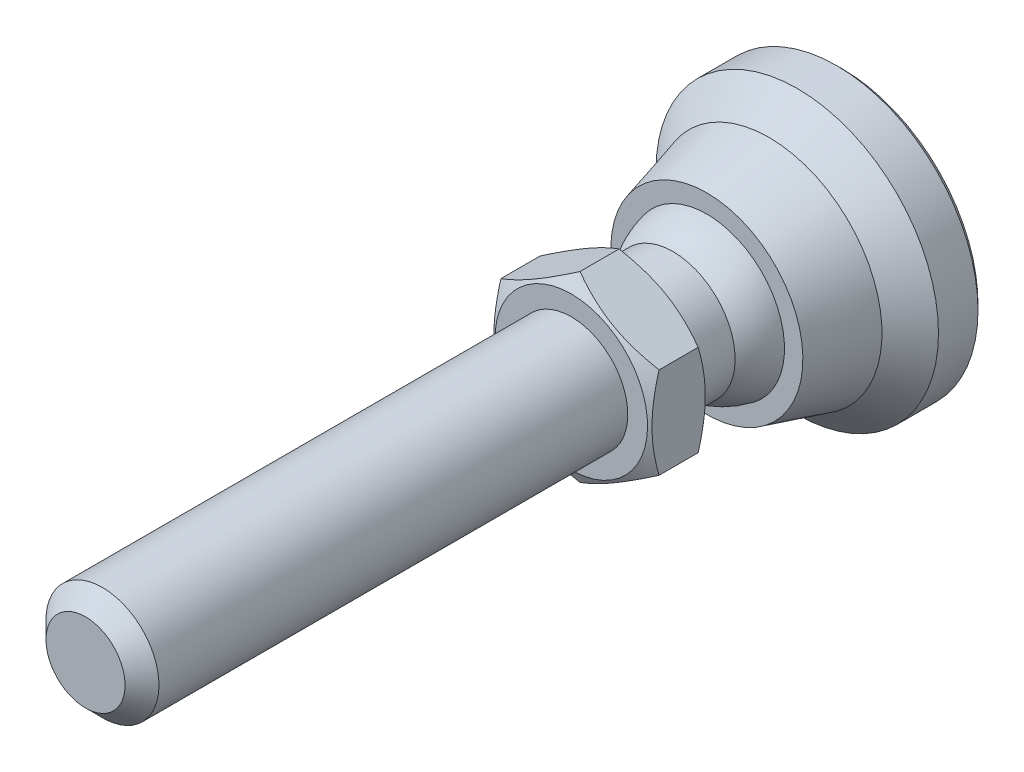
ISO-10303-21;
HEADER;
FILE_DESCRIPTION(('STEP AP214'),'2;1');
FILE_NAME('part.step','',(''),(''),'','','');
FILE_SCHEMA(('AUTOMOTIVE_DESIGN { 1 0 10303 214 1 1 1 1 }'));
ENDSEC;
DATA;
#1=APPLICATION_CONTEXT('core data for automotive mechanical design processes');
#2=APPLICATION_PROTOCOL_DEFINITION('international standard','automotive_design',2000,#1);
#3=PRODUCT_CONTEXT('',#1,'mechanical');
#4=PRODUCT('Part','Part','',(#3));
#5=PRODUCT_RELATED_PRODUCT_CATEGORY('part','',(#4));
#6=PRODUCT_DEFINITION_FORMATION('','',#4);
#7=PRODUCT_DEFINITION_CONTEXT('part definition',#1,'design');
#8=PRODUCT_DEFINITION('design','',#6,#7);
#9=PRODUCT_DEFINITION_SHAPE('','',#8);
#10=(LENGTH_UNIT() NAMED_UNIT(*) SI_UNIT(.MILLI.,.METRE.));
#11=(NAMED_UNIT(*) PLANE_ANGLE_UNIT() SI_UNIT($,.RADIAN.));
#12=(NAMED_UNIT(*) SI_UNIT($,.STERADIAN.) SOLID_ANGLE_UNIT());
#13=UNCERTAINTY_MEASURE_WITH_UNIT(LENGTH_MEASURE(1.E-05),#10,'distance_accuracy_value','');
#14=(GEOMETRIC_REPRESENTATION_CONTEXT(3) GLOBAL_UNCERTAINTY_ASSIGNED_CONTEXT((#13)) GLOBAL_UNIT_ASSIGNED_CONTEXT((#10,
#11,#12)) REPRESENTATION_CONTEXT('',''));
#15=CARTESIAN_POINT('',(0.,0.,0.));
#16=DIRECTION('',(0.,0.,1.));
#17=DIRECTION('',(1.,0.,0.));
#18=AXIS2_PLACEMENT_3D('',#15,#16,#17);
#19=CARTESIAN_POINT('',(-5.49999999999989,0.,19.));
#20=DIRECTION('',(0.,0.,1.));
#21=DIRECTION('',(0.,-1.,0.));
#22=AXIS2_PLACEMENT_3D('',#19,#20,#21);
#23=PLANE('',#22);
#24=CARTESIAN_POINT('',(0.,0.,19.));
#25=DIRECTION('',(0.,0.,-1.));
#26=DIRECTION('',(0.,1.,0.));
#27=AXIS2_PLACEMENT_3D('',#24,#25,#26);
#28=CIRCLE('',#27,5.49999999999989);
#29=CARTESIAN_POINT('',(0.,5.49999999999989,19.));
#30=VERTEX_POINT('',#29);
#31=EDGE_CURVE('E115',#30,#30,#28,.T.);
#32=ORIENTED_EDGE('',*,*,#31,.F.);
#33=EDGE_LOOP('',(#32));
#34=FACE_BOUND('',#33,.T.);
#35=CARTESIAN_POINT('',(0.,0.,18.9999999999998));
#36=DIRECTION('',(0.,0.,-1.));
#37=DIRECTION('',(0.,1.,0.));
#38=AXIS2_PLACEMENT_3D('',#35,#36,#37);
#39=CIRCLE('',#38,6.75);
#40=CARTESIAN_POINT('',(0.,6.75,18.9999999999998));
#41=VERTEX_POINT('',#40);
#42=EDGE_CURVE('E73',#41,#41,#39,.T.);
#43=ORIENTED_EDGE('',*,*,#42,.T.);
#44=EDGE_LOOP('',(#43));
#45=FACE_BOUND('',#44,.T.);
#46=ADVANCED_FACE('F14',(#34,#45),#23,.F.);
#47=CARTESIAN_POINT('',(0.,0.,0.));
#48=DIRECTION('',(0.,0.,-1.));
#49=DIRECTION('',(0.,1.,0.));
#50=AXIS2_PLACEMENT_3D('',#47,#48,#49);
#51=CYLINDRICAL_SURFACE('',#50,5.49999999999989);
#52=CARTESIAN_POINT('',(0.,0.,15.));
#53=DIRECTION('',(0.,0.,-1.));
#54=DIRECTION('',(0.,1.,0.));
#55=AXIS2_PLACEMENT_3D('',#52,#53,#54);
#56=CIRCLE('',#55,5.49999999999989);
#57=CARTESIAN_POINT('',(-5.49999999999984,0.,15.));
#58=VERTEX_POINT('',#57);
#59=EDGE_CURVE('E112',#58,#58,#56,.T.);
#60=ORIENTED_EDGE('',*,*,#59,.F.);
#61=EDGE_LOOP('',(#60));
#62=FACE_BOUND('',#61,.T.);
#63=ORIENTED_EDGE('',*,*,#31,.T.);
#64=EDGE_LOOP('',(#63));
#65=FACE_BOUND('',#64,.T.);
#66=ADVANCED_FACE('F139',(#62,#65),#51,.T.);
#67=CARTESIAN_POINT('',(1.11022302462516E-13,0.,10.6698729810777));
#68=DIRECTION('',(0.,0.,-1.));
#69=DIRECTION('',(-1.,0.,0.));
#70=AXIS2_PLACEMENT_3D('',#67,#68,#69);
#71=SPHERICAL_SURFACE('',#70,7.);
#72=CARTESIAN_POINT('',(0.,0.,12.));
#73=DIRECTION('',(0.,0.,-1.));
#74=DIRECTION('',(0.,1.,0.));
#75=AXIS2_PLACEMENT_3D('',#72,#73,#74);
#76=CIRCLE('',#75,6.87246404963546);
#77=CARTESIAN_POINT('',(-6.87246404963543,0.,12.));
#78=VERTEX_POINT('',#77);
#79=EDGE_CURVE('E109',#78,#78,#76,.T.);
#80=CARTESIAN_POINT('',(-6.87246404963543,0.,12.));
#81=CARTESIAN_POINT('',(-6.86587210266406,0.,12.0340591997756));
#82=CARTESIAN_POINT('',(-6.85902692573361,0.,12.0680693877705));
#83=CARTESIAN_POINT('',(-6.84483171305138,0.,12.1359842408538));
#84=CARTESIAN_POINT('',(-6.8374816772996,0.,12.1698889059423));
#85=CARTESIAN_POINT('',(-6.82227834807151,0.,12.2375852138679));
#86=CARTESIAN_POINT('',(-6.8144250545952,0.,12.2713768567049));
#87=CARTESIAN_POINT('',(-6.79821695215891,0.,12.3388396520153));
#88=CARTESIAN_POINT('',(-6.78986214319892,0.,12.3725108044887));
#89=CARTESIAN_POINT('',(-6.77265285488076,0.,12.4397251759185));
#90=CARTESIAN_POINT('',(-6.76379837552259,0.,12.473268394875));
#91=CARTESIAN_POINT('',(-6.74559170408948,0.,12.5402194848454));
#92=CARTESIAN_POINT('',(-6.73623951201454,0.,12.5736273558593));
#93=CARTESIAN_POINT('',(-6.71703948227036,0.,12.6403003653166));
#94=CARTESIAN_POINT('',(-6.70719164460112,0.,12.67356550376));
#95=CARTESIAN_POINT('',(-6.68700250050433,0.,12.7399456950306));
#96=CARTESIAN_POINT('',(-6.67666119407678,0.,12.7730607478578));
#97=CARTESIAN_POINT('',(-6.65548739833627,0.,12.8391334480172));
#98=CARTESIAN_POINT('',(-6.6446549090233,0.,12.8720910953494));
#99=CARTESIAN_POINT('',(-6.62250114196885,0.,12.9378416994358));
#100=CARTESIAN_POINT('',(-6.61117986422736,0.,12.9706346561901));
#101=CARTESIAN_POINT('',(-6.58805102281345,0.,13.0360486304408));
#102=CARTESIAN_POINT('',(-6.57624345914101,0.,13.0686696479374));
#103=CARTESIAN_POINT('',(-6.55214465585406,0.,13.1337325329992));
#104=CARTESIAN_POINT('',(-6.53985341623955,0.,13.1661744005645));
#105=CARTESIAN_POINT('',(-6.51478997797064,0.,13.2308718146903));
#106=CARTESIAN_POINT('',(-6.50201777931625,0.,13.2631273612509));
#107=CARTESIAN_POINT('',(-6.47599524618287,0.,13.3274450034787));
#108=CARTESIAN_POINT('',(-6.46274491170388,0.,13.3595070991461));
#109=CARTESIAN_POINT('',(-6.43576903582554,0.,13.4234307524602));
#110=CARTESIAN_POINT('',(-6.42204349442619,0.,13.455292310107));
#111=CARTESIAN_POINT('',(-6.39412023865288,0.,13.5188078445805));
#112=CARTESIAN_POINT('',(-6.37992252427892,0.,13.5504618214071));
#113=CARTESIAN_POINT('',(-6.35105806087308,0.,13.6135551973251));
#114=CARTESIAN_POINT('',(-6.33639131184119,0.,13.6449945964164));
#115=CARTESIAN_POINT('',(-6.30659202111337,0.,13.7076518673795));
#116=CARTESIAN_POINT('',(-6.29145947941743,0.,13.7388697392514));
#117=CARTESIAN_POINT('',(-6.26073194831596,0.,13.8010770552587));
#118=CARTESIAN_POINT('',(-6.24513695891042,0.,13.8320664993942));
#119=CARTESIAN_POINT('',(-6.2134879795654,0.,13.8938101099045));
#120=CARTESIAN_POINT('',(-6.19743398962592,0.,13.9245642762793));
#121=CARTESIAN_POINT('',(-6.16487055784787,0.,13.9858305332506));
#122=CARTESIAN_POINT('',(-6.1483611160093,0.,14.016342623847));
#123=CARTESIAN_POINT('',(-6.11489042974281,0.,14.0771179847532));
#124=CARTESIAN_POINT('',(-6.09792918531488,0.,14.107381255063));
#125=CARTESIAN_POINT('',(-6.06355864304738,0.,14.1676522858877));
#126=CARTESIAN_POINT('',(-6.0461493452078,0.,14.1976600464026));
#127=CARTESIAN_POINT('',(-6.01088654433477,0.,14.2574134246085));
#128=CARTESIAN_POINT('',(-5.99303304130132,0.,14.2871590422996));
#129=CARTESIAN_POINT('',(-5.95688577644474,0.,14.3463815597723));
#130=CARTESIAN_POINT('',(-5.9385920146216,0.,14.3758584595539));
#131=CARTESIAN_POINT('',(-5.90156827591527,0.,14.4345370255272));
#132=CARTESIAN_POINT('',(-5.88283829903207,0.,14.4637386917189));
#133=CARTESIAN_POINT('',(-5.84494627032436,0.,14.5218603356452));
#134=CARTESIAN_POINT('',(-5.82578421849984,0.,14.5507803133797));
#135=CARTESIAN_POINT('',(-5.78703227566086,0.,14.6083321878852));
#136=CARTESIAN_POINT('',(-5.76744238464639,0.,14.6369640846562));
#137=CARTESIAN_POINT('',(-5.72783909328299,0.,14.6939334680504));
#138=CARTESIAN_POINT('',(-5.70782569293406,0.,14.7222709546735));
#139=CARTESIAN_POINT('',(-5.66737980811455,0.,14.778645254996));
#140=CARTESIAN_POINT('',(-5.64694732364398,0.,14.8066820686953));
#141=CARTESIAN_POINT('',(-5.60566778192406,0.,14.862448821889));
#142=CARTESIAN_POINT('',(-5.58482072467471,0.,14.8901787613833));
#143=CARTESIAN_POINT('',(-5.5427166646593,0.,14.9453256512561));
#144=CARTESIAN_POINT('',(-5.52145966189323,0.,14.9727426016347));
#145=CARTESIAN_POINT('',(-5.49999999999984,0.,15.));
#146=B_SPLINE_CURVE_WITH_KNOTS('',3,(#80,#81,#82,#83,#84,#85,#86,#87,#88,#89,#90,#91,#92,#93,
#94,#95,#96,#97,#98,#99,#100,#101,#102,#103,#104,#105,#106,#107,#108,#109,#110,#111,#112,#113,
#114,#115,#116,#117,#118,#119,#120,#121,#122,#123,#124,#125,#126,#127,#128,#129,#130,#131,#132,
#133,#134,#135,#136,#137,#138,#139,#140,#141,#142,#143,#144,#145),.UNSPECIFIED.,.F.,.F.,(4,2,2,
2,2,2,2,2,2,2,2,2,2,2,2,2,2,2,2,2,2,2,2,2,2,2,2,2,2,2,2,2,4),(0.,0.104072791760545,
0.208145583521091,0.312218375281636,0.416291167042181,0.520363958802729,0.624436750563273,
0.72850954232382,0.832582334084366,0.936655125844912,1.04072791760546,1.144800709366,
1.24887350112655,1.35294629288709,1.45701908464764,1.56109187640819,1.66516466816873,
1.76923745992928,1.87331025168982,1.97738304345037,2.08145583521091,2.18552862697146,
2.28960141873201,2.39367421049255,2.4977470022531,2.60181979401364,2.70589258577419,
2.80996537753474,2.91403816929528,3.01811096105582,3.12218375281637,3.22625654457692,
3.33032933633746),.UNSPECIFIED.);
#147=EDGE_CURVE('BSEAM146',#78,#58,#146,.T.);
#148=ORIENTED_EDGE('',*,*,#79,.F.);
#149=ORIENTED_EDGE('',*,*,#59,.T.);
#150=ORIENTED_EDGE('',*,*,#147,.T.);
#151=ORIENTED_EDGE('',*,*,#147,.F.);
#152=EDGE_LOOP('',(#148,#150,#149,#151));
#153=FACE_BOUND('',#152,.T.);
#154=ADVANCED_FACE('F146',(#153),#71,.T.);
#155=CARTESIAN_POINT('',(-8.5,0.,12.));
#156=DIRECTION('',(0.,0.,-1.));
#157=DIRECTION('',(0.,1.,0.));
#158=AXIS2_PLACEMENT_3D('',#155,#156,#157);
#159=PLANE('',#158);
#160=CARTESIAN_POINT('',(0.,0.,12.));
#161=DIRECTION('',(0.,0.,-1.));
#162=DIRECTION('',(0.,1.,0.));
#163=AXIS2_PLACEMENT_3D('',#160,#161,#162);
#164=CIRCLE('',#163,8.5);
#165=CARTESIAN_POINT('',(0.,8.5,12.));
#166=VERTEX_POINT('',#165);
#167=EDGE_CURVE('E106',#166,#166,#164,.T.);
#168=ORIENTED_EDGE('',*,*,#167,.F.);
#169=EDGE_LOOP('',(#168));
#170=FACE_BOUND('',#169,.T.);
#171=ORIENTED_EDGE('',*,*,#79,.T.);
#172=EDGE_LOOP('',(#171));
#173=FACE_BOUND('',#172,.T.);
#174=ADVANCED_FACE('F250',(#170,#173),#159,.F.);
#175=CARTESIAN_POINT('',(0.,0.,12.));
#176=DIRECTION('',(0.,0.,-1.));
#177=DIRECTION('',(0.,1.,0.));
#178=AXIS2_PLACEMENT_3D('',#175,#176,#177);
#179=CONICAL_SURFACE('',#178,8.5,0.266252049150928);
#180=CARTESIAN_POINT('',(0.,0.,6.5));
#181=DIRECTION('',(0.,0.,-1.));
#182=DIRECTION('',(0.,1.,0.));
#183=AXIS2_PLACEMENT_3D('',#180,#181,#182);
#184=CIRCLE('',#183,10.);
#185=CARTESIAN_POINT('',(0.,10.,6.5));
#186=VERTEX_POINT('',#185);
#187=EDGE_CURVE('E103',#186,#186,#184,.T.);
#188=ORIENTED_EDGE('',*,*,#187,.F.);
#189=EDGE_LOOP('',(#188));
#190=FACE_BOUND('',#189,.T.);
#191=ORIENTED_EDGE('',*,*,#167,.T.);
#192=EDGE_LOOP('',(#191));
#193=FACE_BOUND('',#192,.T.);
#194=ADVANCED_FACE('F246',(#190,#193),#179,.T.);
#195=CARTESIAN_POINT('',(0.,0.,6.5));
#196=DIRECTION('',(0.,0.,-1.));
#197=DIRECTION('',(0.,1.,0.));
#198=AXIS2_PLACEMENT_3D('',#195,#196,#197);
#199=CONICAL_SURFACE('',#198,10.,0.785398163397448);
#200=CARTESIAN_POINT('',(0.,0.,4.));
#201=DIRECTION('',(0.,0.,-1.));
#202=DIRECTION('',(0.,1.,0.));
#203=AXIS2_PLACEMENT_3D('',#200,#201,#202);
#204=CIRCLE('',#203,12.5);
#205=CARTESIAN_POINT('',(0.,12.5,4.));
#206=VERTEX_POINT('',#205);
#207=EDGE_CURVE('E100',#206,#206,#204,.T.);
#208=ORIENTED_EDGE('',*,*,#207,.F.);
#209=EDGE_LOOP('',(#208));
#210=FACE_BOUND('',#209,.T.);
#211=ORIENTED_EDGE('',*,*,#187,.T.);
#212=EDGE_LOOP('',(#211));
#213=FACE_BOUND('',#212,.T.);
#214=ADVANCED_FACE('F242',(#210,#213),#199,.T.);
#215=CARTESIAN_POINT('',(0.,0.,0.));
#216=DIRECTION('',(0.,0.,-1.));
#217=DIRECTION('',(0.,1.,0.));
#218=AXIS2_PLACEMENT_3D('',#215,#216,#217);
#219=CYLINDRICAL_SURFACE('',#218,12.5);
#220=CARTESIAN_POINT('',(0.,0.,0.5));
#221=DIRECTION('',(0.,0.,-1.));
#222=DIRECTION('',(0.,1.,0.));
#223=AXIS2_PLACEMENT_3D('',#220,#221,#222);
#224=CIRCLE('',#223,12.5);
#225=CARTESIAN_POINT('',(0.,12.5,0.5));
#226=VERTEX_POINT('',#225);
#227=EDGE_CURVE('E97',#226,#226,#224,.T.);
#228=ORIENTED_EDGE('',*,*,#227,.F.);
#229=EDGE_LOOP('',(#228));
#230=FACE_BOUND('',#229,.T.);
#231=ORIENTED_EDGE('',*,*,#207,.T.);
#232=EDGE_LOOP('',(#231));
#233=FACE_BOUND('',#232,.T.);
#234=ADVANCED_FACE('F238',(#230,#233),#219,.T.);
#235=CARTESIAN_POINT('',(0.,0.,0.5));
#236=DIRECTION('',(0.,0.,1.));
#237=DIRECTION('',(0.,-1.,0.));
#238=AXIS2_PLACEMENT_3D('',#235,#236,#237);
#239=CONICAL_SURFACE('',#238,12.5,0.785398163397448);
#240=CARTESIAN_POINT('',(0.,0.,0.));
#241=DIRECTION('',(0.,0.,-1.));
#242=DIRECTION('',(0.,1.,0.));
#243=AXIS2_PLACEMENT_3D('',#240,#241,#242);
#244=CIRCLE('',#243,12.);
#245=CARTESIAN_POINT('',(0.,12.,0.));
#246=VERTEX_POINT('',#245);
#247=EDGE_CURVE('E94',#246,#246,#244,.T.);
#248=ORIENTED_EDGE('',*,*,#247,.F.);
#249=EDGE_LOOP('',(#248));
#250=FACE_BOUND('',#249,.T.);
#251=ORIENTED_EDGE('',*,*,#227,.T.);
#252=EDGE_LOOP('',(#251));
#253=FACE_BOUND('',#252,.T.);
#254=ADVANCED_FACE('F234',(#250,#253),#239,.T.);
#255=CARTESIAN_POINT('',(-12.,0.,0.));
#256=DIRECTION('',(0.,0.,1.));
#257=DIRECTION('',(0.,-1.,0.));
#258=AXIS2_PLACEMENT_3D('',#255,#256,#257);
#259=PLANE('',#258);
#260=ORIENTED_EDGE('',*,*,#247,.T.);
#261=EDGE_LOOP('',(#260));
#262=FACE_BOUND('',#261,.T.);
#263=ADVANCED_FACE('F136',(#262),#259,.F.);
#264=CARTESIAN_POINT('',(0.,0.,18.9999999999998));
#265=DIRECTION('',(0.,0.,1.));
#266=DIRECTION('',(0.,-1.,0.));
#267=AXIS2_PLACEMENT_3D('',#264,#265,#266);
#268=CONICAL_SURFACE('',#267,6.75,1.0471975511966);
#269=CARTESIAN_POINT('',(-7.,10.8505398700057,22.5579558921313));
#270=CARTESIAN_POINT('',(-7.,10.5448474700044,22.4096889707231));
#271=CARTESIAN_POINT('',(-7.,10.2384527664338,22.2628452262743));
#272=CARTESIAN_POINT('',(-7.,9.62388523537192,21.9728046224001));
#273=CARTESIAN_POINT('',(-7.,9.31571213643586,21.8296083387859));
#274=CARTESIAN_POINT('',(-7.,8.69562398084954,21.5469416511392));
#275=CARTESIAN_POINT('',(-7.,8.38369768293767,21.4074958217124));
#276=CARTESIAN_POINT('',(-7.,7.75736232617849,21.1343178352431));
#277=CARTESIAN_POINT('',(-7.,7.442953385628,21.0005854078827));
#278=CARTESIAN_POINT('',(-7.,6.80102569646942,20.7361715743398));
#279=CARTESIAN_POINT('',(-7.,6.47340962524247,20.6057251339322));
#280=CARTESIAN_POINT('',(-7.,5.81434344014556,20.3547177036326));
#281=CARTESIAN_POINT('',(-7.,5.48289290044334,20.2341578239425));
#282=CARTESIAN_POINT('',(-7.,4.81624852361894,20.0060926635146));
#283=CARTESIAN_POINT('',(-7.,4.48106384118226,19.8985609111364));
#284=CARTESIAN_POINT('',(-7.,3.80589849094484,19.7000045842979));
#285=CARTESIAN_POINT('',(-7.,3.4659193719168,19.6089748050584));
#286=CARTESIAN_POINT('',(-7.,2.78280098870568,19.4482842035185));
#287=CARTESIAN_POINT('',(-7.,2.43968968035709,19.3785077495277));
#288=CARTESIAN_POINT('',(-7.,1.92190245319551,19.2928066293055));
#289=CARTESIAN_POINT('',(-7.,1.74877391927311,19.2673990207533));
#290=CARTESIAN_POINT('',(-7.,1.40165810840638,19.2234034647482));
#291=CARTESIAN_POINT('',(-7.,1.22767091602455,19.2048148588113));
#292=CARTESIAN_POINT('',(-7.,0.8813416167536,19.1750605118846));
#293=CARTESIAN_POINT('',(-7.,0.709007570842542,19.1638013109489));
#294=CARTESIAN_POINT('',(-7.,0.364017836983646,19.1485801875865));
#295=CARTESIAN_POINT('',(-7.,0.191362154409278,19.1446181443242));
#296=CARTESIAN_POINT('',(-7.,-0.153962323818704,19.144085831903));
#297=CARTESIAN_POINT('',(-7.,-0.326631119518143,19.1475155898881));
#298=CARTESIAN_POINT('',(-7.,-0.671670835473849,19.1616831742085));
#299=CARTESIAN_POINT('',(-7.,-0.844041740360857,19.1724213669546));
#300=CARTESIAN_POINT('',(-7.,-1.25845901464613,19.2067970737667));
#301=CARTESIAN_POINT('',(-7.,-1.50022308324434,19.233910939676));
#302=CARTESIAN_POINT('',(-7.,-1.98194203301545,19.3010355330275));
#303=CARTESIAN_POINT('',(-7.,-2.22189666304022,19.3410480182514));
#304=CARTESIAN_POINT('',(-7.,-2.93878025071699,19.4783104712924));
#305=CARTESIAN_POINT('',(-7.,-3.41245871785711,19.5927600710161));
#306=CARTESIAN_POINT('',(-7.,-4.1207304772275,19.7910439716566));
#307=CARTESIAN_POINT('',(-7.,-4.35900205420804,19.8624934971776));
#308=CARTESIAN_POINT('',(-7.,-4.83323061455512,20.0127684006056));
#309=CARTESIAN_POINT('',(-7.,-5.06918758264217,20.0915938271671));
#310=CARTESIAN_POINT('',(-7.,-5.53886204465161,20.2553595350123));
#311=CARTESIAN_POINT('',(-7.,-5.77258025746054,20.3402977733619));
#312=CARTESIAN_POINT('',(-7.,-6.23808324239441,20.5152942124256));
#313=CARTESIAN_POINT('',(-7.,-6.46986803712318,20.6053523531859));
#314=CARTESIAN_POINT('',(-7.,-7.01672411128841,20.8236739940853));
#315=CARTESIAN_POINT('',(-7.,-7.33105066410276,20.9537994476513));
#316=CARTESIAN_POINT('',(-7.,-7.95703357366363,21.2203402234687));
#317=CARTESIAN_POINT('',(-7.,-8.26868976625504,21.3567559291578));
#318=CARTESIAN_POINT('',(-7.,-8.88982323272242,21.634613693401));
#319=CARTESIAN_POINT('',(-7.,-9.19930005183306,21.7760567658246));
#320=CARTESIAN_POINT('',(-7.,-9.81638795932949,22.062963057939));
#321=CARTESIAN_POINT('',(-7.,-10.1239990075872,22.2084263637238));
#322=CARTESIAN_POINT('',(-7.,-10.7379832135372,22.5027727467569));
#323=CARTESIAN_POINT('',(-7.,-11.0443546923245,22.6516593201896));
#324=CARTESIAN_POINT('',(-7.,-11.6557778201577,22.9521207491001));
#325=CARTESIAN_POINT('',(-7.,-11.9608294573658,23.1036956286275));
#326=CARTESIAN_POINT('',(-7.,-12.8742387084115,23.5616969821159));
#327=CARTESIAN_POINT('',(-7.,-13.4809331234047,23.8714400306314));
#328=CARTESIAN_POINT('',(-7.,-14.6403141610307,24.4708871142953));
#329=CARTESIAN_POINT('',(-7.,-15.1932603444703,24.7600913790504));
#330=CARTESIAN_POINT('',(-7.,-16.2970994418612,25.3424365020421));
#331=CARTESIAN_POINT('',(-7.,-16.8479922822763,25.6355774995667));
#332=CARTESIAN_POINT('',(-7.,-17.9468036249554,26.2241220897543));
#333=CARTESIAN_POINT('',(-7.,-18.4947261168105,26.5195182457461));
#334=CARTESIAN_POINT('',(-7.,-19.5892583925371,27.1126618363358));
#335=CARTESIAN_POINT('',(-7.,-20.135868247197,27.4104091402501));
#336=CARTESIAN_POINT('',(-7.,-20.6819950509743,27.7090339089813));
#337=B_SPLINE_CURVE_WITH_KNOTS('',3,(#269,#270,#271,#272,#273,#274,#275,#276,#277,#278,#279,
#280,#281,#282,#283,#284,#285,#286,#287,#288,#289,#290,#291,#292,#293,#294,#295,#296,#297,#298,
#299,#300,#301,#302,#303,#304,#305,#306,#307,#308,#309,#310,#311,#312,#313,#314,#315,#316,#317,
#318,#319,#320,#321,#322,#323,#324,#325,#326,#327,#328,#329,#330,#331,#332,#333,#334,#335,#336),
.UNSPECIFIED.,.F.,.F.,(4,2,2,2,2,2,2,2,2,2,2,2,2,2,2,2,2,2,2,2,2,2,2,2,2,2,2,2,2,2,2,2,2,4),(0.,
1.01926626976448,2.03869246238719,3.06367747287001,4.08861393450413,5.14638287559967,
6.20427043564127,7.25997109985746,8.3153382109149,9.36485643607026,9.88969215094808,
10.4144771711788,10.9324321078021,11.4503784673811,11.9683267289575,12.4863009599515,
13.2157278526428,13.9452541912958,15.4051173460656,16.1513165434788,16.8975206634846,
17.6434765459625,18.3894236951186,19.4099215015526,20.4304815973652,21.451248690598,
22.4720376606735,23.4939200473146,24.5158115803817,26.5593199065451,28.4313332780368,
30.3034130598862,32.170838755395,34.0381613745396),.UNSPECIFIED.);
#338=CARTESIAN_POINT('',(-7.,4.04145188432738,19.7695523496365));
#339=VERTEX_POINT('',#338);
#340=CARTESIAN_POINT('',(-7.,-4.04145188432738,19.7695523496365));
#341=VERTEX_POINT('',#340);
#342=EDGE_CURVE('E79',#339,#341,#337,.T.);
#343=ORIENTED_EDGE('',*,*,#342,.F.);
#344=CARTESIAN_POINT('',(0.000199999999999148,8.0830192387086,19.7696190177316));
#345=CARTESIAN_POINT('',(-0.153667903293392,7.99418356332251,19.7183374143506));
#346=CARTESIAN_POINT('',(-0.308109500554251,7.90501666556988,19.6693831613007));
#347=CARTESIAN_POINT('',(-0.618246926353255,7.72595873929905,19.5767703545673));
#348=CARTESIAN_POINT('',(-0.773943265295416,7.63606741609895,19.5331140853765));
#349=CARTESIAN_POINT('',(-1.24352516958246,7.36495417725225,19.4109491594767));
#350=CARTESIAN_POINT('',(-1.5592643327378,7.18266208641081,19.3414631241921));
#351=CARTESIAN_POINT('',(-2.03176224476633,6.9098652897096,19.2599825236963));
#352=CARTESIAN_POINT('',(-2.18710922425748,6.82017566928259,19.2367710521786));
#353=CARTESIAN_POINT('',(-2.49850511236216,6.64039116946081,19.1978487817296));
#354=CARTESIAN_POINT('',(-2.65455395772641,6.55029632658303,19.1821373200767));
#355=CARTESIAN_POINT('',(-2.96692267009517,6.36995016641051,19.1586154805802));
#356=CARTESIAN_POINT('',(-3.12324202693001,6.27969914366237,19.15079613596));
#357=CARTESIAN_POINT('',(-3.43601650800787,6.09911871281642,19.1432178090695));
#358=CARTESIAN_POINT('',(-3.59247162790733,6.00878930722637,19.1434585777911));
#359=CARTESIAN_POINT('',(-4.02110687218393,5.76131663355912,19.1551972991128));
#360=CARTESIAN_POINT('',(-4.2931466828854,5.60425437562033,19.1749033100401));
#361=CARTESIAN_POINT('',(-4.83541944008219,5.29117305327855,19.2373910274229));
#362=CARTESIAN_POINT('',(-5.10565047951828,5.13515508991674,19.2801940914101));
#363=CARTESIAN_POINT('',(-5.64901454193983,4.82144370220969,19.3871892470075));
#364=CARTESIAN_POINT('',(-5.92207900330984,4.66378986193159,19.4518346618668));
#365=CARTESIAN_POINT('',(-6.46413578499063,4.35083323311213,19.5985536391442));
#366=CARTESIAN_POINT('',(-6.73313504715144,4.19552643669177,19.6805927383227));
#367=CARTESIAN_POINT('',(-7.0002,4.04133641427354,19.7696190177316));
#368=B_SPLINE_CURVE_WITH_KNOTS('',3,(#344,#345,#346,#347,#348,#349,#350,#351,#352,#353,#354,
#355,#356,#357,#358,#359,#360,#361,#362,#363,#364,#365,#366,#367),.UNSPECIFIED.,.F.,.F.,(4,2,2,
2,2,2,2,2,2,2,2,4),(0.,0.554727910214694,1.10969417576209,2.2219327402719,2.76443041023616,
3.30688013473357,3.84871284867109,4.39052882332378,5.33376515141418,6.27787517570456,
7.2429241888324,8.20607866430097),.UNSPECIFIED.);
#369=CARTESIAN_POINT('',(0.,8.08290376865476,19.7695523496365));
#370=VERTEX_POINT('',#369);
#371=EDGE_CURVE('E406',#370,#339,#368,.T.);
#372=ORIENTED_EDGE('',*,*,#371,.F.);
#373=CARTESIAN_POINT('',(7.0002,4.04133641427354,19.7696190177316));
#374=CARTESIAN_POINT('',(6.84633209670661,4.13017208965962,19.7183374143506));
#375=CARTESIAN_POINT('',(6.69189049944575,4.21933898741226,19.6693831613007));
#376=CARTESIAN_POINT('',(6.38175307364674,4.39839691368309,19.5767703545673));
#377=CARTESIAN_POINT('',(6.22605673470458,4.48828823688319,19.5331140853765));
#378=CARTESIAN_POINT('',(5.75647483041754,4.75940147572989,19.4109491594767));
#379=CARTESIAN_POINT('',(5.4407356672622,4.94169356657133,19.3414631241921));
#380=CARTESIAN_POINT('',(4.96823775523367,5.21449036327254,19.2599825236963));
#381=CARTESIAN_POINT('',(4.81289077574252,5.30417998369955,19.2367710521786));
#382=CARTESIAN_POINT('',(4.50149488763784,5.48396448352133,19.1978487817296));
#383=CARTESIAN_POINT('',(4.3454460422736,5.57405932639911,19.1821373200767));
#384=CARTESIAN_POINT('',(4.03307732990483,5.75440548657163,19.1586154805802));
#385=CARTESIAN_POINT('',(3.87675797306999,5.84465650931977,19.15079613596));
#386=CARTESIAN_POINT('',(3.56398349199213,6.02523694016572,19.1432178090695));
#387=CARTESIAN_POINT('',(3.40752837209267,6.11556634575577,19.1434585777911));
#388=CARTESIAN_POINT('',(2.97889312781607,6.36303901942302,19.1551972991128));
#389=CARTESIAN_POINT('',(2.7068533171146,6.52010127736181,19.1749033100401));
#390=CARTESIAN_POINT('',(2.16458055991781,6.83318259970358,19.2373910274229));
#391=CARTESIAN_POINT('',(1.89434952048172,6.9892005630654,19.2801940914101));
#392=CARTESIAN_POINT('',(1.35098545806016,7.30291195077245,19.3871892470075));
#393=CARTESIAN_POINT('',(1.07792099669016,7.46056579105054,19.4518346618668));
#394=CARTESIAN_POINT('',(0.535864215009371,7.77352241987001,19.5985536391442));
#395=CARTESIAN_POINT('',(0.26686495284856,7.92882921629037,19.6805927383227));
#396=CARTESIAN_POINT('',(-0.000200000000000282,8.0830192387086,19.7696190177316));
#397=B_SPLINE_CURVE_WITH_KNOTS('',3,(#373,#374,#375,#376,#377,#378,#379,#380,#381,#382,#383,
#384,#385,#386,#387,#388,#389,#390,#391,#392,#393,#394,#395,#396),.UNSPECIFIED.,.F.,.F.,(4,2,2,
2,2,2,2,2,2,2,2,4),(0.,0.554727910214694,1.10969417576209,2.2219327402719,2.76443041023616,
3.30688013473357,3.84871284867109,4.39052882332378,5.33376515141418,6.27787517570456,
7.2429241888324,8.20607866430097),.UNSPECIFIED.);
#398=CARTESIAN_POINT('',(7.,4.04145188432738,19.7695523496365));
#399=VERTEX_POINT('',#398);
#400=EDGE_CURVE('E394',#399,#370,#397,.T.);
#401=ORIENTED_EDGE('',*,*,#400,.F.);
#402=CARTESIAN_POINT('',(7.,10.8505398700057,22.5579558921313));
#403=CARTESIAN_POINT('',(7.,10.5448474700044,22.4096889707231));
#404=CARTESIAN_POINT('',(7.,10.2384527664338,22.2628452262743));
#405=CARTESIAN_POINT('',(7.,9.62388523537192,21.9728046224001));
#406=CARTESIAN_POINT('',(7.,9.31571213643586,21.8296083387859));
#407=CARTESIAN_POINT('',(7.,8.69562398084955,21.5469416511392));
#408=CARTESIAN_POINT('',(7.,8.38369768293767,21.4074958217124));
#409=CARTESIAN_POINT('',(7.,7.75736232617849,21.1343178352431));
#410=CARTESIAN_POINT('',(7.,7.442953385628,21.0005854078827));
#411=CARTESIAN_POINT('',(7.,6.80102569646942,20.7361715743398));
#412=CARTESIAN_POINT('',(7.,6.47340962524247,20.6057251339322));
#413=CARTESIAN_POINT('',(7.,5.81434344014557,20.3547177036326));
#414=CARTESIAN_POINT('',(7.,5.48289290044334,20.2341578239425));
#415=CARTESIAN_POINT('',(7.,4.81624852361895,20.0060926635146));
#416=CARTESIAN_POINT('',(7.,4.48106384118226,19.8985609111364));
#417=CARTESIAN_POINT('',(7.,3.80589849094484,19.7000045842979));
#418=CARTESIAN_POINT('',(7.,3.4659193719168,19.6089748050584));
#419=CARTESIAN_POINT('',(7.,2.78280098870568,19.4482842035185));
#420=CARTESIAN_POINT('',(7.,2.43968968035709,19.3785077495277));
#421=CARTESIAN_POINT('',(7.,1.92190245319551,19.2928066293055));
#422=CARTESIAN_POINT('',(7.,1.74877391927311,19.2673990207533));
#423=CARTESIAN_POINT('',(7.,1.40165810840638,19.2234034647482));
#424=CARTESIAN_POINT('',(7.,1.22767091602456,19.2048148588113));
#425=CARTESIAN_POINT('',(7.,0.881341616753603,19.1750605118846));
#426=CARTESIAN_POINT('',(7.,0.709007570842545,19.1638013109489));
#427=CARTESIAN_POINT('',(7.,0.36401783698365,19.1485801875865));
#428=CARTESIAN_POINT('',(7.,0.191362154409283,19.1446181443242));
#429=CARTESIAN_POINT('',(7.,-0.153962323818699,19.144085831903));
#430=CARTESIAN_POINT('',(7.,-0.326631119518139,19.1475155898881));
#431=CARTESIAN_POINT('',(7.,-0.671670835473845,19.1616831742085));
#432=CARTESIAN_POINT('',(7.,-0.844041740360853,19.1724213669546));
#433=CARTESIAN_POINT('',(7.,-1.25845901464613,19.2067970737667));
#434=CARTESIAN_POINT('',(7.,-1.50022308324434,19.233910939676));
#435=CARTESIAN_POINT('',(7.,-1.98194203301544,19.3010355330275));
#436=CARTESIAN_POINT('',(7.,-2.22189666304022,19.3410480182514));
#437=CARTESIAN_POINT('',(7.,-2.93878025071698,19.4783104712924));
#438=CARTESIAN_POINT('',(7.,-3.4124587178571,19.5927600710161));
#439=CARTESIAN_POINT('',(7.,-4.1207304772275,19.7910439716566));
#440=CARTESIAN_POINT('',(7.,-4.35900205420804,19.8624934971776));
#441=CARTESIAN_POINT('',(7.,-4.83323061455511,20.0127684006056));
#442=CARTESIAN_POINT('',(7.,-5.06918758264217,20.0915938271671));
#443=CARTESIAN_POINT('',(7.,-5.53886204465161,20.2553595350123));
#444=CARTESIAN_POINT('',(7.,-5.77258025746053,20.3402977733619));
#445=CARTESIAN_POINT('',(7.,-6.2380832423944,20.5152942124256));
#446=CARTESIAN_POINT('',(7.,-6.46986803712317,20.6053523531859));
#447=CARTESIAN_POINT('',(7.,-7.0167241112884,20.8236739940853));
#448=CARTESIAN_POINT('',(7.,-7.33105066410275,20.9537994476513));
#449=CARTESIAN_POINT('',(7.,-7.95703357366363,21.2203402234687));
#450=CARTESIAN_POINT('',(7.,-8.26868976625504,21.3567559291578));
#451=CARTESIAN_POINT('',(7.,-8.88982323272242,21.634613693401));
#452=CARTESIAN_POINT('',(7.,-9.19930005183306,21.7760567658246));
#453=CARTESIAN_POINT('',(7.,-9.81638795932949,22.062963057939));
#454=CARTESIAN_POINT('',(7.,-10.1239990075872,22.2084263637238));
#455=CARTESIAN_POINT('',(7.,-10.7379832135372,22.5027727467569));
#456=CARTESIAN_POINT('',(7.,-11.0443546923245,22.6516593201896));
#457=CARTESIAN_POINT('',(7.,-11.6557778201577,22.9521207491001));
#458=CARTESIAN_POINT('',(7.,-11.9608294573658,23.1036956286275));
#459=CARTESIAN_POINT('',(7.,-12.8742387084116,23.5616969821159));
#460=CARTESIAN_POINT('',(7.,-13.4809331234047,23.8714400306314));
#461=CARTESIAN_POINT('',(7.,-14.6403141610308,24.4708871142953));
#462=CARTESIAN_POINT('',(7.,-15.1932603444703,24.7600913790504));
#463=CARTESIAN_POINT('',(7.,-16.2970994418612,25.3424365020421));
#464=CARTESIAN_POINT('',(7.,-16.8479922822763,25.6355774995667));
#465=CARTESIAN_POINT('',(7.,-17.9468036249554,26.2241220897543));
#466=CARTESIAN_POINT('',(7.,-18.4947261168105,26.5195182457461));
#467=CARTESIAN_POINT('',(7.,-19.5892583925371,27.1126618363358));
#468=CARTESIAN_POINT('',(7.,-20.135868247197,27.4104091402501));
#469=CARTESIAN_POINT('',(7.,-20.6819950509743,27.7090339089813));
#470=B_SPLINE_CURVE_WITH_KNOTS('',3,(#402,#403,#404,#405,#406,#407,#408,#409,#410,#411,#412,
#413,#414,#415,#416,#417,#418,#419,#420,#421,#422,#423,#424,#425,#426,#427,#428,#429,#430,#431,
#432,#433,#434,#435,#436,#437,#438,#439,#440,#441,#442,#443,#444,#445,#446,#447,#448,#449,#450,
#451,#452,#453,#454,#455,#456,#457,#458,#459,#460,#461,#462,#463,#464,#465,#466,#467,#468,#469),
.UNSPECIFIED.,.F.,.F.,(4,2,2,2,2,2,2,2,2,2,2,2,2,2,2,2,2,2,2,2,2,2,2,2,2,2,2,2,2,2,2,2,2,4),(0.,
1.01926626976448,2.03869246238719,3.06367747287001,4.08861393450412,5.14638287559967,
6.20427043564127,7.25997109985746,8.3153382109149,9.36485643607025,9.88969215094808,
10.4144771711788,10.9324321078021,11.4503784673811,11.9683267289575,12.4863009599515,
13.2157278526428,13.9452541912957,15.4051173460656,16.1513165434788,16.8975206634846,
17.6434765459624,18.3894236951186,19.4099215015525,20.4304815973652,21.451248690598,
22.4720376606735,23.4939200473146,24.5158115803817,26.5593199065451,28.4313332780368,
30.3034130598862,32.170838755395,34.0381613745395),.UNSPECIFIED.);
#471=CARTESIAN_POINT('',(7.,-4.04145188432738,19.7695523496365));
#472=VERTEX_POINT('',#471);
#473=EDGE_CURVE('E29',#472,#399,#470,.F.);
#474=ORIENTED_EDGE('',*,*,#473,.F.);
#475=CARTESIAN_POINT('',(-0.00019999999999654,-8.08301923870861,19.7696190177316));
#476=CARTESIAN_POINT('',(0.153667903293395,-7.99418356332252,19.7183374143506));
#477=CARTESIAN_POINT('',(0.308109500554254,-7.90501666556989,19.6693831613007));
#478=CARTESIAN_POINT('',(0.618246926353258,-7.72595873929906,19.5767703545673));
#479=CARTESIAN_POINT('',(0.773943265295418,-7.63606741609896,19.5331140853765));
#480=CARTESIAN_POINT('',(1.24352516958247,-7.36495417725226,19.4109491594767));
#481=CARTESIAN_POINT('',(1.5592643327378,-7.18266208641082,19.3414631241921));
#482=CARTESIAN_POINT('',(2.03176224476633,-6.90986528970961,19.2599825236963));
#483=CARTESIAN_POINT('',(2.18710922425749,-6.8201756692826,19.2367710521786));
#484=CARTESIAN_POINT('',(2.49850511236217,-6.64039116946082,19.1978487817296));
#485=CARTESIAN_POINT('',(2.65455395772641,-6.55029632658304,19.1821373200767));
#486=CARTESIAN_POINT('',(2.96692267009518,-6.36995016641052,19.1586154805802));
#487=CARTESIAN_POINT('',(3.12324202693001,-6.27969914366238,19.15079613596));
#488=CARTESIAN_POINT('',(3.43601650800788,-6.09911871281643,19.1432178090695));
#489=CARTESIAN_POINT('',(3.59247162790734,-6.00878930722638,19.1434585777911));
#490=CARTESIAN_POINT('',(4.02110687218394,-5.76131663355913,19.1551972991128));
#491=CARTESIAN_POINT('',(4.2931466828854,-5.60425437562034,19.1749033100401));
#492=CARTESIAN_POINT('',(4.8354194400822,-5.29117305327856,19.2373910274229));
#493=CARTESIAN_POINT('',(5.10565047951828,-5.13515508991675,19.2801940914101));
#494=CARTESIAN_POINT('',(5.64901454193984,-4.8214437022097,19.3871892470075));
#495=CARTESIAN_POINT('',(5.92207900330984,-4.66378986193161,19.4518346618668));
#496=CARTESIAN_POINT('',(6.46413578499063,-4.35083323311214,19.5985536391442));
#497=CARTESIAN_POINT('',(6.73313504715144,-4.19552643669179,19.6805927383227));
#498=CARTESIAN_POINT('',(7.0002,-4.04133641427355,19.7696190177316));
#499=B_SPLINE_CURVE_WITH_KNOTS('',3,(#475,#476,#477,#478,#479,#480,#481,#482,#483,#484,#485,
#486,#487,#488,#489,#490,#491,#492,#493,#494,#495,#496,#497,#498),.UNSPECIFIED.,.F.,.F.,(4,2,2,
2,2,2,2,2,2,2,2,4),(0.,0.554727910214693,1.10969417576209,2.2219327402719,2.76443041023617,
3.30688013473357,3.84871284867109,4.39052882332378,5.33376515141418,6.27787517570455,
7.24292418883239,8.20607866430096),.UNSPECIFIED.);
#500=CARTESIAN_POINT('',(0.,-8.08290376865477,19.7695523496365));
#501=VERTEX_POINT('',#500);
#502=EDGE_CURVE('E66',#501,#472,#499,.T.);
#503=ORIENTED_EDGE('',*,*,#502,.F.);
#504=CARTESIAN_POINT('',(-7.0002,-4.04133641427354,19.7696190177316));
#505=CARTESIAN_POINT('',(-6.84633209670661,-4.13017208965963,19.7183374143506));
#506=CARTESIAN_POINT('',(-6.69189049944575,-4.21933898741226,19.6693831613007));
#507=CARTESIAN_POINT('',(-6.38175307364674,-4.3983969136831,19.5767703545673));
#508=CARTESIAN_POINT('',(-6.22605673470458,-4.48828823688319,19.5331140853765));
#509=CARTESIAN_POINT('',(-5.75647483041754,-4.7594014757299,19.4109491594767));
#510=CARTESIAN_POINT('',(-5.4407356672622,-4.94169356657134,19.3414631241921));
#511=CARTESIAN_POINT('',(-4.96823775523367,-5.21449036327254,19.2599825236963));
#512=CARTESIAN_POINT('',(-4.81289077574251,-5.30417998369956,19.2367710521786));
#513=CARTESIAN_POINT('',(-4.50149488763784,-5.48396448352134,19.1978487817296));
#514=CARTESIAN_POINT('',(-4.34544604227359,-5.57405932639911,19.1821373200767));
#515=CARTESIAN_POINT('',(-4.03307732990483,-5.75440548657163,19.1586154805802));
#516=CARTESIAN_POINT('',(-3.87675797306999,-5.84465650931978,19.15079613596));
#517=CARTESIAN_POINT('',(-3.56398349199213,-6.02523694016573,19.1432178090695));
#518=CARTESIAN_POINT('',(-3.40752837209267,-6.11556634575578,19.1434585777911));
#519=CARTESIAN_POINT('',(-2.97889312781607,-6.36303901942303,19.1551972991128));
#520=CARTESIAN_POINT('',(-2.7068533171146,-6.52010127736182,19.1749033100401));
#521=CARTESIAN_POINT('',(-2.1645805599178,-6.83318259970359,19.2373910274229));
#522=CARTESIAN_POINT('',(-1.89434952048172,-6.9892005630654,19.2801940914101));
#523=CARTESIAN_POINT('',(-1.35098545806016,-7.30291195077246,19.3871892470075));
#524=CARTESIAN_POINT('',(-1.07792099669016,-7.46056579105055,19.4518346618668));
#525=CARTESIAN_POINT('',(-0.535864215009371,-7.77352241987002,19.5985536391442));
#526=CARTESIAN_POINT('',(-0.266864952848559,-7.92882921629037,19.6805927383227));
#527=CARTESIAN_POINT('',(0.000200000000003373,-8.0830192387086,19.7696190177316));
#528=B_SPLINE_CURVE_WITH_KNOTS('',3,(#504,#505,#506,#507,#508,#509,#510,#511,#512,#513,#514,
#515,#516,#517,#518,#519,#520,#521,#522,#523,#524,#525,#526,#527),.UNSPECIFIED.,.F.,.F.,(4,2,2,
2,2,2,2,2,2,2,2,4),(0.,0.554727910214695,1.10969417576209,2.2219327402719,2.76443041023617,
3.30688013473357,3.8487128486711,4.39052882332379,5.33376515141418,6.27787517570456,
7.2429241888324,8.20607866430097),.UNSPECIFIED.);
#529=EDGE_CURVE('E69',#341,#501,#528,.T.);
#530=ORIENTED_EDGE('',*,*,#529,.F.);
#531=EDGE_LOOP('',(#343,#372,#401,#474,#503,#530));
#532=FACE_BOUND('',#531,.T.);
#533=ORIENTED_EDGE('',*,*,#42,.F.);
#534=EDGE_LOOP('',(#533));
#535=FACE_BOUND('',#534,.T.);
#536=ADVANCED_FACE('F67',(#532,#535),#268,.T.);
#537=CARTESIAN_POINT('',(-3.49999999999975,0.,67.));
#538=DIRECTION('',(0.,0.,-1.));
#539=DIRECTION('',(0.,1.,0.));
#540=AXIS2_PLACEMENT_3D('',#537,#538,#539);
#541=PLANE('',#540);
#542=CARTESIAN_POINT('',(0.,0.,67.));
#543=DIRECTION('',(0.,0.,-1.));
#544=DIRECTION('',(0.,1.,0.));
#545=AXIS2_PLACEMENT_3D('',#542,#543,#544);
#546=CIRCLE('',#545,3.49999999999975);
#547=CARTESIAN_POINT('',(0.,3.49999999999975,67.));
#548=VERTEX_POINT('',#547);
#549=EDGE_CURVE('E9',#548,#548,#546,.T.);
#550=ORIENTED_EDGE('',*,*,#549,.F.);
#551=EDGE_LOOP('',(#550));
#552=FACE_BOUND('',#551,.T.);
#553=ADVANCED_FACE('F16',(#552),#541,.F.);
#554=CARTESIAN_POINT('',(0.,0.,67.));
#555=DIRECTION('',(0.,0.,-1.));
#556=DIRECTION('',(0.,1.,0.));
#557=AXIS2_PLACEMENT_3D('',#554,#555,#556);
#558=CONICAL_SURFACE('',#557,3.49999999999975,0.785398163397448);
#559=CARTESIAN_POINT('',(0.,0.,65.5));
#560=DIRECTION('',(0.,0.,-1.));
#561=DIRECTION('',(0.,1.,0.));
#562=AXIS2_PLACEMENT_3D('',#559,#560,#561);
#563=CIRCLE('',#562,4.99999999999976);
#564=CARTESIAN_POINT('',(0.,4.99999999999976,65.5));
#565=VERTEX_POINT('',#564);
#566=EDGE_CURVE('E22',#565,#565,#563,.T.);
#567=ORIENTED_EDGE('',*,*,#566,.F.);
#568=EDGE_LOOP('',(#567));
#569=FACE_BOUND('',#568,.T.);
#570=ORIENTED_EDGE('',*,*,#549,.T.);
#571=EDGE_LOOP('',(#570));
#572=FACE_BOUND('',#571,.T.);
#573=ADVANCED_FACE('F125',(#569,#572),#558,.T.);
#574=CARTESIAN_POINT('',(0.,0.,0.));
#575=DIRECTION('',(0.,0.,-1.));
#576=DIRECTION('',(0.,1.,0.));
#577=AXIS2_PLACEMENT_3D('',#574,#575,#576);
#578=CYLINDRICAL_SURFACE('',#577,4.99999999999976);
#579=CARTESIAN_POINT('',(0.,0.,23.9999999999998));
#580=DIRECTION('',(0.,0.,-1.));
#581=DIRECTION('',(0.,1.,0.));
#582=AXIS2_PLACEMENT_3D('',#579,#580,#581);
#583=CIRCLE('',#582,4.99999999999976);
#584=CARTESIAN_POINT('',(0.,4.99999999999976,23.9999999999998));
#585=VERTEX_POINT('',#584);
#586=EDGE_CURVE('E118',#585,#585,#583,.T.);
#587=ORIENTED_EDGE('',*,*,#586,.F.);
#588=EDGE_LOOP('',(#587));
#589=FACE_BOUND('',#588,.T.);
#590=ORIENTED_EDGE('',*,*,#566,.T.);
#591=EDGE_LOOP('',(#590));
#592=FACE_BOUND('',#591,.T.);
#593=ADVANCED_FACE('F123',(#589,#592),#578,.T.);
#594=CARTESIAN_POINT('',(-4.99999999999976,0.,23.9999999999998));
#595=DIRECTION('',(0.,0.,-1.));
#596=DIRECTION('',(0.,1.,0.));
#597=AXIS2_PLACEMENT_3D('',#594,#595,#596);
#598=PLANE('',#597);
#599=ORIENTED_EDGE('',*,*,#586,.T.);
#600=EDGE_LOOP('',(#599));
#601=FACE_BOUND('',#600,.T.);
#602=CARTESIAN_POINT('',(0.,0.,23.9999999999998));
#603=DIRECTION('',(0.,0.,-1.));
#604=DIRECTION('',(0.,1.,0.));
#605=AXIS2_PLACEMENT_3D('',#602,#603,#604);
#606=CIRCLE('',#605,6.75);
#607=CARTESIAN_POINT('',(0.,6.75,23.9999999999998));
#608=VERTEX_POINT('',#607);
#609=EDGE_CURVE('E78',#608,#608,#606,.T.);
#610=ORIENTED_EDGE('',*,*,#609,.F.);
#611=EDGE_LOOP('',(#610));
#612=FACE_BOUND('',#611,.T.);
#613=ADVANCED_FACE('F153',(#601,#612),#598,.F.);
#614=CARTESIAN_POINT('',(0.,0.,22.1383615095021));
#615=DIRECTION('',(0.,0.,-1.));
#616=DIRECTION('',(0.,1.,0.));
#617=AXIS2_PLACEMENT_3D('',#614,#615,#616);
#618=CONICAL_SURFACE('',#617,9.97445245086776,1.0471975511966);
#619=CARTESIAN_POINT('',(7.0002,-4.04133641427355,23.2303809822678));
#620=CARTESIAN_POINT('',(6.84633209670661,-4.13017208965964,23.2816625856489));
#621=CARTESIAN_POINT('',(6.69189049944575,-4.21933898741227,23.3306168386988));
#622=CARTESIAN_POINT('',(6.38175307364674,-4.3983969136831,23.4232296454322));
#623=CARTESIAN_POINT('',(6.22605673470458,-4.4882882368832,23.466885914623));
#624=CARTESIAN_POINT('',(5.75647483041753,-4.7594014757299,23.5890508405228));
#625=CARTESIAN_POINT('',(5.4407356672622,-4.94169356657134,23.6585368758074));
#626=CARTESIAN_POINT('',(4.96823775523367,-5.21449036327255,23.7400174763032));
#627=CARTESIAN_POINT('',(4.81289077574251,-5.30417998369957,23.7632289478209));
#628=CARTESIAN_POINT('',(4.50149488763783,-5.48396448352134,23.8021512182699));
#629=CARTESIAN_POINT('',(4.34544604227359,-5.57405932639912,23.8178626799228));
#630=CARTESIAN_POINT('',(4.03307732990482,-5.75440548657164,23.8413845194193));
#631=CARTESIAN_POINT('',(3.87675797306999,-5.84465650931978,23.8492038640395));
#632=CARTESIAN_POINT('',(3.56398349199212,-6.02523694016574,23.85678219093));
#633=CARTESIAN_POINT('',(3.40752837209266,-6.11556634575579,23.8565414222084));
#634=CARTESIAN_POINT('',(2.97889312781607,-6.36303901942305,23.8448027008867));
#635=CARTESIAN_POINT('',(2.7068533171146,-6.52010127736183,23.8250966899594));
#636=CARTESIAN_POINT('',(2.16458055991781,-6.83318259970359,23.7626089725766));
#637=CARTESIAN_POINT('',(1.89434952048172,-6.98920056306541,23.7198059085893));
#638=CARTESIAN_POINT('',(1.35098545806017,-7.30291195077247,23.612810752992));
#639=CARTESIAN_POINT('',(1.07792099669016,-7.46056579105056,23.5481653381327));
#640=CARTESIAN_POINT('',(0.535864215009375,-7.77352241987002,23.4014463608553));
#641=CARTESIAN_POINT('',(0.266864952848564,-7.92882921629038,23.3194072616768));
#642=CARTESIAN_POINT('',(-0.000199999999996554,-8.08301923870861,23.2303809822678));
#643=B_SPLINE_CURVE_WITH_KNOTS('',3,(#619,#620,#621,#622,#623,#624,#625,#626,#627,#628,#629,
#630,#631,#632,#633,#634,#635,#636,#637,#638,#639,#640,#641,#642),.UNSPECIFIED.,.F.,.F.,(4,2,2,
2,2,2,2,2,2,2,2,4),(0.,0.554727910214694,1.10969417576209,2.2219327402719,2.76443041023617,
3.30688013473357,3.84871284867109,4.39052882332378,5.33376515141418,6.27787517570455,
7.24292418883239,8.20607866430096),.UNSPECIFIED.);
#644=CARTESIAN_POINT('',(7.,-4.04145188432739,23.2304476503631));
#645=VERTEX_POINT('',#644);
#646=CARTESIAN_POINT('',(0.,-8.08290376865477,23.2304476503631));
#647=VERTEX_POINT('',#646);
#648=EDGE_CURVE('E84',#645,#647,#643,.T.);
#649=ORIENTED_EDGE('',*,*,#648,.F.);
#650=CARTESIAN_POINT('',(7.,10.8505398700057,20.4420441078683));
#651=CARTESIAN_POINT('',(7.,10.5448474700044,20.5903110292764));
#652=CARTESIAN_POINT('',(7.,10.2384527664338,20.7371547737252));
#653=CARTESIAN_POINT('',(7.,9.62388523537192,21.0271953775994));
#654=CARTESIAN_POINT('',(7.,9.31571213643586,21.1703916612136));
#655=CARTESIAN_POINT('',(7.,8.69562398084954,21.4530583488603));
#656=CARTESIAN_POINT('',(7.,8.38369768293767,21.5925041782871));
#657=CARTESIAN_POINT('',(7.,7.75736232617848,21.8656821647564));
#658=CARTESIAN_POINT('',(7.,7.44295338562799,21.9994145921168));
#659=CARTESIAN_POINT('',(7.,6.80102569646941,22.2638284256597));
#660=CARTESIAN_POINT('',(7.,6.47340962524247,22.3942748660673));
#661=CARTESIAN_POINT('',(7.,5.81434344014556,22.6452822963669));
#662=CARTESIAN_POINT('',(7.,5.48289290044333,22.765842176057));
#663=CARTESIAN_POINT('',(7.,4.81624852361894,22.9939073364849));
#664=CARTESIAN_POINT('',(7.,4.48106384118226,23.1014390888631));
#665=CARTESIAN_POINT('',(7.,3.80589849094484,23.2999954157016));
#666=CARTESIAN_POINT('',(7.,3.4659193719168,23.3910251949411));
#667=CARTESIAN_POINT('',(7.,2.78280098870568,23.551715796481));
#668=CARTESIAN_POINT('',(7.,2.43968968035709,23.6214922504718));
#669=CARTESIAN_POINT('',(7.,1.92190245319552,23.707193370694));
#670=CARTESIAN_POINT('',(7.,1.74877391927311,23.7326009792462));
#671=CARTESIAN_POINT('',(7.,1.40165810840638,23.7765965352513));
#672=CARTESIAN_POINT('',(7.,1.22767091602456,23.7951851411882));
#673=CARTESIAN_POINT('',(7.,0.881341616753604,23.8249394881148));
#674=CARTESIAN_POINT('',(7.,0.709007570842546,23.8361986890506));
#675=CARTESIAN_POINT('',(7.,0.36401783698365,23.851419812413));
#676=CARTESIAN_POINT('',(7.,0.191362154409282,23.8553818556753));
#677=CARTESIAN_POINT('',(7.,-0.153962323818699,23.8559141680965));
#678=CARTESIAN_POINT('',(7.,-0.326631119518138,23.8524844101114));
#679=CARTESIAN_POINT('',(7.,-0.671670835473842,23.838316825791));
#680=CARTESIAN_POINT('',(7.,-0.844041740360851,23.8275786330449));
#681=CARTESIAN_POINT('',(7.,-1.25845901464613,23.7932029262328));
#682=CARTESIAN_POINT('',(7.,-1.50022308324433,23.7660890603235));
#683=CARTESIAN_POINT('',(7.,-1.98194203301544,23.698964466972));
#684=CARTESIAN_POINT('',(7.,-2.22189666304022,23.6589519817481));
#685=CARTESIAN_POINT('',(7.,-2.93878025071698,23.5216895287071));
#686=CARTESIAN_POINT('',(7.,-3.4124587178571,23.4072399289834));
#687=CARTESIAN_POINT('',(7.,-4.1207304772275,23.2089560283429));
#688=CARTESIAN_POINT('',(7.,-4.35900205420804,23.1375065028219));
#689=CARTESIAN_POINT('',(7.,-4.83323061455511,22.9872315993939));
#690=CARTESIAN_POINT('',(7.,-5.06918758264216,22.9084061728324));
#691=CARTESIAN_POINT('',(7.,-5.5388620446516,22.7446404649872));
#692=CARTESIAN_POINT('',(7.,-5.77258025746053,22.6597022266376));
#693=CARTESIAN_POINT('',(7.,-6.2380832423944,22.4847057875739));
#694=CARTESIAN_POINT('',(7.,-6.46986803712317,22.3946476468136));
#695=CARTESIAN_POINT('',(7.,-7.01672411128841,22.1763260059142));
#696=CARTESIAN_POINT('',(7.,-7.33105066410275,22.0462005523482));
#697=CARTESIAN_POINT('',(7.,-7.95703357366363,21.7796597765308));
#698=CARTESIAN_POINT('',(7.,-8.26868976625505,21.6432440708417));
#699=CARTESIAN_POINT('',(7.,-8.88982323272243,21.3653863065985));
#700=CARTESIAN_POINT('',(7.,-9.19930005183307,21.2239432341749));
#701=CARTESIAN_POINT('',(7.,-9.8163879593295,20.9370369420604));
#702=CARTESIAN_POINT('',(7.,-10.1239990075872,20.7915736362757));
#703=CARTESIAN_POINT('',(7.,-10.7379832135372,20.4972272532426));
#704=CARTESIAN_POINT('',(7.,-11.0443546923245,20.3483406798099));
#705=CARTESIAN_POINT('',(7.,-11.6557778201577,20.0478792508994));
#706=CARTESIAN_POINT('',(7.,-11.9608294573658,19.896304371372));
#707=CARTESIAN_POINT('',(7.,-12.8742387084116,19.4383030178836));
#708=CARTESIAN_POINT('',(7.,-13.4809331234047,19.128559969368));
#709=CARTESIAN_POINT('',(7.,-14.6403141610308,18.5291128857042));
#710=CARTESIAN_POINT('',(7.,-15.1932603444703,18.2399086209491));
#711=CARTESIAN_POINT('',(7.,-16.2970994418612,17.6575634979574));
#712=CARTESIAN_POINT('',(7.,-16.8479922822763,17.3644225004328));
#713=CARTESIAN_POINT('',(7.,-17.9468036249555,16.7758779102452));
#714=CARTESIAN_POINT('',(7.,-18.4947261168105,16.4804817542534));
#715=CARTESIAN_POINT('',(7.,-19.5892583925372,15.8873381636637));
#716=CARTESIAN_POINT('',(7.,-20.135868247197,15.5895908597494));
#717=CARTESIAN_POINT('',(7.,-20.6819950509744,15.2909660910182));
#718=B_SPLINE_CURVE_WITH_KNOTS('',3,(#650,#651,#652,#653,#654,#655,#656,#657,#658,#659,#660,
#661,#662,#663,#664,#665,#666,#667,#668,#669,#670,#671,#672,#673,#674,#675,#676,#677,#678,#679,
#680,#681,#682,#683,#684,#685,#686,#687,#688,#689,#690,#691,#692,#693,#694,#695,#696,#697,#698,
#699,#700,#701,#702,#703,#704,#705,#706,#707,#708,#709,#710,#711,#712,#713,#714,#715,#716,#717),
.UNSPECIFIED.,.F.,.F.,(4,2,2,2,2,2,2,2,2,2,2,2,2,2,2,2,2,2,2,2,2,2,2,2,2,2,2,2,2,2,2,2,2,4),(0.,
1.01926626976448,2.03869246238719,3.06367747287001,4.08861393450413,5.14638287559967,
6.20427043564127,7.25997109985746,8.3153382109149,9.36485643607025,9.88969215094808,
10.4144771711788,10.9324321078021,11.4503784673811,11.9683267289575,12.4863009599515,
13.2157278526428,13.9452541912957,15.4051173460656,16.1513165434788,16.8975206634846,
17.6434765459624,18.3894236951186,19.4099215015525,20.4304815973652,21.451248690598,
22.4720376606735,23.4939200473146,24.5158115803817,26.5593199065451,28.4313332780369,
30.3034130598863,32.170838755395,34.0381613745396),.UNSPECIFIED.);
#719=CARTESIAN_POINT('',(7.,4.04145188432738,23.2304476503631));
#720=VERTEX_POINT('',#719);
#721=EDGE_CURVE('E169',#720,#645,#718,.T.);
#722=ORIENTED_EDGE('',*,*,#721,.F.);
#723=CARTESIAN_POINT('',(-0.000200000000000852,8.0830192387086,23.2303809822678));
#724=CARTESIAN_POINT('',(0.153667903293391,7.99418356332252,23.2816625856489));
#725=CARTESIAN_POINT('',(0.30810950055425,7.90501666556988,23.3306168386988));
#726=CARTESIAN_POINT('',(0.618246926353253,7.72595873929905,23.4232296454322));
#727=CARTESIAN_POINT('',(0.773943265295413,7.63606741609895,23.466885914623));
#728=CARTESIAN_POINT('',(1.24352516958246,7.36495417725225,23.5890508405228));
#729=CARTESIAN_POINT('',(1.5592643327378,7.18266208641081,23.6585368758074));
#730=CARTESIAN_POINT('',(2.03176224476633,6.9098652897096,23.7400174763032));
#731=CARTESIAN_POINT('',(2.18710922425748,6.82017566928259,23.7632289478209));
#732=CARTESIAN_POINT('',(2.49850511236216,6.64039116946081,23.8021512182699));
#733=CARTESIAN_POINT('',(2.6545539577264,6.55029632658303,23.8178626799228));
#734=CARTESIAN_POINT('',(2.96692267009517,6.36995016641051,23.8413845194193));
#735=CARTESIAN_POINT('',(3.12324202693,6.27969914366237,23.8492038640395));
#736=CARTESIAN_POINT('',(3.43601650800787,6.09911871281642,23.85678219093));
#737=CARTESIAN_POINT('',(3.59247162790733,6.00878930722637,23.8565414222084));
#738=CARTESIAN_POINT('',(4.02110687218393,5.76131663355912,23.8448027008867));
#739=CARTESIAN_POINT('',(4.29314668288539,5.60425437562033,23.8250966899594));
#740=CARTESIAN_POINT('',(4.83541944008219,5.29117305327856,23.7626089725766));
#741=CARTESIAN_POINT('',(5.10565047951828,5.13515508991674,23.7198059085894));
#742=CARTESIAN_POINT('',(5.64901454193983,4.82144370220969,23.612810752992));
#743=CARTESIAN_POINT('',(5.92207900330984,4.66378986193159,23.5481653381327));
#744=CARTESIAN_POINT('',(6.46413578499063,4.35083323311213,23.4014463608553));
#745=CARTESIAN_POINT('',(6.73313504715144,4.19552643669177,23.3194072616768));
#746=CARTESIAN_POINT('',(7.0002,4.04133641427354,23.2303809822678));
#747=B_SPLINE_CURVE_WITH_KNOTS('',3,(#723,#724,#725,#726,#727,#728,#729,#730,#731,#732,#733,
#734,#735,#736,#737,#738,#739,#740,#741,#742,#743,#744,#745,#746),.UNSPECIFIED.,.F.,.F.,(4,2,2,
2,2,2,2,2,2,2,2,4),(0.,0.554727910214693,1.10969417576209,2.22193274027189,2.76443041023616,
3.30688013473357,3.84871284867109,4.39052882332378,5.33376515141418,6.27787517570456,
7.2429241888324,8.20607866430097),.UNSPECIFIED.);
#748=CARTESIAN_POINT('',(0.,8.08290376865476,23.2304476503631));
#749=VERTEX_POINT('',#748);
#750=EDGE_CURVE('E204',#749,#720,#747,.T.);
#751=ORIENTED_EDGE('',*,*,#750,.F.);
#752=CARTESIAN_POINT('',(-7.0002,4.04133641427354,23.2303809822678));
#753=CARTESIAN_POINT('',(-6.84633209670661,4.13017208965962,23.2816625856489));
#754=CARTESIAN_POINT('',(-6.69189049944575,4.21933898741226,23.3306168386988));
#755=CARTESIAN_POINT('',(-6.38175307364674,4.39839691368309,23.4232296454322));
#756=CARTESIAN_POINT('',(-6.22605673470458,4.48828823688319,23.466885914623));
#757=CARTESIAN_POINT('',(-5.75647483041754,4.75940147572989,23.5890508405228));
#758=CARTESIAN_POINT('',(-5.4407356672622,4.94169356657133,23.6585368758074));
#759=CARTESIAN_POINT('',(-4.96823775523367,5.21449036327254,23.7400174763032));
#760=CARTESIAN_POINT('',(-4.81289077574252,5.30417998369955,23.7632289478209));
#761=CARTESIAN_POINT('',(-4.50149488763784,5.48396448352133,23.8021512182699));
#762=CARTESIAN_POINT('',(-4.34544604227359,5.57405932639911,23.8178626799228));
#763=CARTESIAN_POINT('',(-4.03307732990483,5.75440548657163,23.8413845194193));
#764=CARTESIAN_POINT('',(-3.87675797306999,5.84465650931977,23.8492038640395));
#765=CARTESIAN_POINT('',(-3.56398349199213,6.02523694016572,23.85678219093));
#766=CARTESIAN_POINT('',(-3.40752837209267,6.11556634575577,23.8565414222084));
#767=CARTESIAN_POINT('',(-2.97889312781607,6.36303901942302,23.8448027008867));
#768=CARTESIAN_POINT('',(-2.7068533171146,6.52010127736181,23.8250966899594));
#769=CARTESIAN_POINT('',(-2.16458055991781,6.83318259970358,23.7626089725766));
#770=CARTESIAN_POINT('',(-1.89434952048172,6.9892005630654,23.7198059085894));
#771=CARTESIAN_POINT('',(-1.35098545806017,7.30291195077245,23.612810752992));
#772=CARTESIAN_POINT('',(-1.07792099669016,7.46056579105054,23.5481653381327));
#773=CARTESIAN_POINT('',(-0.535864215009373,7.77352241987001,23.4014463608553));
#774=CARTESIAN_POINT('',(-0.266864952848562,7.92882921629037,23.3194072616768));
#775=CARTESIAN_POINT('',(0.000199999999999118,8.0830192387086,23.2303809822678));
#776=B_SPLINE_CURVE_WITH_KNOTS('',3,(#752,#753,#754,#755,#756,#757,#758,#759,#760,#761,#762,
#763,#764,#765,#766,#767,#768,#769,#770,#771,#772,#773,#774,#775),.UNSPECIFIED.,.F.,.F.,(4,2,2,
2,2,2,2,2,2,2,2,4),(0.,0.554727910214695,1.10969417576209,2.2219327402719,2.76443041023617,
3.30688013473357,3.84871284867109,4.39052882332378,5.33376515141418,6.27787517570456,
7.2429241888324,8.20607866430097),.UNSPECIFIED.);
#777=CARTESIAN_POINT('',(-7.,4.04145188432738,23.2304476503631));
#778=VERTEX_POINT('',#777);
#779=EDGE_CURVE('E211',#778,#749,#776,.T.);
#780=ORIENTED_EDGE('',*,*,#779,.F.);
#781=CARTESIAN_POINT('',(-7.,10.8505398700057,20.4420441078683));
#782=CARTESIAN_POINT('',(-7.,10.5448474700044,20.5903110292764));
#783=CARTESIAN_POINT('',(-7.,10.2384527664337,20.7371547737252));
#784=CARTESIAN_POINT('',(-7.,9.62388523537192,21.0271953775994));
#785=CARTESIAN_POINT('',(-7.,9.31571213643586,21.1703916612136));
#786=CARTESIAN_POINT('',(-7.,8.69562398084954,21.4530583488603));
#787=CARTESIAN_POINT('',(-7.,8.38369768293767,21.5925041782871));
#788=CARTESIAN_POINT('',(-7.,7.75736232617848,21.8656821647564));
#789=CARTESIAN_POINT('',(-7.,7.44295338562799,21.9994145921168));
#790=CARTESIAN_POINT('',(-7.,6.80102569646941,22.2638284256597));
#791=CARTESIAN_POINT('',(-7.,6.47340962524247,22.3942748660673));
#792=CARTESIAN_POINT('',(-7.,5.81434344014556,22.6452822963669));
#793=CARTESIAN_POINT('',(-7.,5.48289290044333,22.765842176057));
#794=CARTESIAN_POINT('',(-7.,4.81624852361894,22.9939073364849));
#795=CARTESIAN_POINT('',(-7.,4.48106384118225,23.1014390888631));
#796=CARTESIAN_POINT('',(-7.,3.80589849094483,23.2999954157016));
#797=CARTESIAN_POINT('',(-7.,3.4659193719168,23.3910251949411));
#798=CARTESIAN_POINT('',(-7.,2.78280098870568,23.551715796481));
#799=CARTESIAN_POINT('',(-7.,2.43968968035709,23.6214922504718));
#800=CARTESIAN_POINT('',(-7.,1.92190245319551,23.707193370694));
#801=CARTESIAN_POINT('',(-7.,1.74877391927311,23.7326009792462));
#802=CARTESIAN_POINT('',(-7.,1.40165810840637,23.7765965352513));
#803=CARTESIAN_POINT('',(-7.,1.22767091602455,23.7951851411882));
#804=CARTESIAN_POINT('',(-7.,0.8813416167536,23.8249394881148));
#805=CARTESIAN_POINT('',(-7.,0.709007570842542,23.8361986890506));
#806=CARTESIAN_POINT('',(-7.,0.364017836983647,23.851419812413));
#807=CARTESIAN_POINT('',(-7.,0.191362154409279,23.8553818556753));
#808=CARTESIAN_POINT('',(-7.,-0.153962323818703,23.8559141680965));
#809=CARTESIAN_POINT('',(-7.,-0.326631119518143,23.8524844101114));
#810=CARTESIAN_POINT('',(-7.,-0.671670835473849,23.838316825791));
#811=CARTESIAN_POINT('',(-7.,-0.844041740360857,23.8275786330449));
#812=CARTESIAN_POINT('',(-7.,-1.25845901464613,23.7932029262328));
#813=CARTESIAN_POINT('',(-7.,-1.50022308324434,23.7660890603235));
#814=CARTESIAN_POINT('',(-7.,-1.98194203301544,23.698964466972));
#815=CARTESIAN_POINT('',(-7.,-2.22189666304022,23.6589519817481));
#816=CARTESIAN_POINT('',(-7.,-2.93878025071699,23.5216895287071));
#817=CARTESIAN_POINT('',(-7.,-3.41245871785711,23.4072399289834));
#818=CARTESIAN_POINT('',(-7.,-4.1207304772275,23.2089560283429));
#819=CARTESIAN_POINT('',(-7.,-4.35900205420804,23.1375065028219));
#820=CARTESIAN_POINT('',(-7.,-4.83323061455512,22.9872315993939));
#821=CARTESIAN_POINT('',(-7.,-5.06918758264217,22.9084061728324));
#822=CARTESIAN_POINT('',(-7.,-5.53886204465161,22.7446404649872));
#823=CARTESIAN_POINT('',(-7.,-5.77258025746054,22.6597022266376));
#824=CARTESIAN_POINT('',(-7.,-6.23808324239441,22.4847057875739));
#825=CARTESIAN_POINT('',(-7.,-6.46986803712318,22.3946476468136));
#826=CARTESIAN_POINT('',(-7.,-7.01672411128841,22.1763260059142));
#827=CARTESIAN_POINT('',(-7.,-7.33105066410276,22.0462005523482));
#828=CARTESIAN_POINT('',(-7.,-7.95703357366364,21.7796597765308));
#829=CARTESIAN_POINT('',(-7.,-8.26868976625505,21.6432440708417));
#830=CARTESIAN_POINT('',(-7.,-8.88982323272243,21.3653863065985));
#831=CARTESIAN_POINT('',(-7.,-9.19930005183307,21.2239432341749));
#832=CARTESIAN_POINT('',(-7.,-9.8163879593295,20.9370369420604));
#833=CARTESIAN_POINT('',(-7.,-10.1239990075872,20.7915736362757));
#834=CARTESIAN_POINT('',(-7.,-10.7379832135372,20.4972272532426));
#835=CARTESIAN_POINT('',(-7.,-11.0443546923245,20.3483406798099));
#836=CARTESIAN_POINT('',(-7.,-11.6557778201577,20.0478792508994));
#837=CARTESIAN_POINT('',(-7.,-11.9608294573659,19.896304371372));
#838=CARTESIAN_POINT('',(-7.,-12.8742387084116,19.4383030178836));
#839=CARTESIAN_POINT('',(-7.,-13.4809331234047,19.128559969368));
#840=CARTESIAN_POINT('',(-7.,-14.6403141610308,18.5291128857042));
#841=CARTESIAN_POINT('',(-7.,-15.1932603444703,18.2399086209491));
#842=CARTESIAN_POINT('',(-7.,-16.2970994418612,17.6575634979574));
#843=CARTESIAN_POINT('',(-7.,-16.8479922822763,17.3644225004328));
#844=CARTESIAN_POINT('',(-7.,-17.9468036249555,16.7758779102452));
#845=CARTESIAN_POINT('',(-7.,-18.4947261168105,16.4804817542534));
#846=CARTESIAN_POINT('',(-7.,-19.5892583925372,15.8873381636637));
#847=CARTESIAN_POINT('',(-7.,-20.135868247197,15.5895908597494));
#848=CARTESIAN_POINT('',(-7.,-20.6819950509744,15.2909660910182));
#849=B_SPLINE_CURVE_WITH_KNOTS('',3,(#781,#782,#783,#784,#785,#786,#787,#788,#789,#790,#791,
#792,#793,#794,#795,#796,#797,#798,#799,#800,#801,#802,#803,#804,#805,#806,#807,#808,#809,#810,
#811,#812,#813,#814,#815,#816,#817,#818,#819,#820,#821,#822,#823,#824,#825,#826,#827,#828,#829,
#830,#831,#832,#833,#834,#835,#836,#837,#838,#839,#840,#841,#842,#843,#844,#845,#846,#847,#848),
.UNSPECIFIED.,.F.,.F.,(4,2,2,2,2,2,2,2,2,2,2,2,2,2,2,2,2,2,2,2,2,2,2,2,2,2,2,2,2,2,2,2,2,4),(0.,
1.01926626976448,2.03869246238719,3.06367747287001,4.08861393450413,5.14638287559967,
6.20427043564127,7.25997109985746,8.3153382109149,9.36485643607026,9.88969215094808,
10.4144771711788,10.9324321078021,11.4503784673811,11.9683267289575,12.4863009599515,
13.2157278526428,13.9452541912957,15.4051173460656,16.1513165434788,16.8975206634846,
17.6434765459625,18.3894236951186,19.4099215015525,20.4304815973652,21.451248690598,
22.4720376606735,23.4939200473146,24.5158115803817,26.5593199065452,28.4313332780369,
30.3034130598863,32.170838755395,34.0381613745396),.UNSPECIFIED.);
#850=CARTESIAN_POINT('',(-7.,-4.04145188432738,23.2304476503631));
#851=VERTEX_POINT('',#850);
#852=EDGE_CURVE('E90',#851,#778,#849,.F.);
#853=ORIENTED_EDGE('',*,*,#852,.F.);
#854=CARTESIAN_POINT('',(0.000200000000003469,-8.0830192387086,23.2303809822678));
#855=CARTESIAN_POINT('',(-0.153667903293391,-7.99418356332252,23.2816625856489));
#856=CARTESIAN_POINT('',(-0.308109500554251,-7.90501666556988,23.3306168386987));
#857=CARTESIAN_POINT('',(-0.618246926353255,-7.72595873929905,23.4232296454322));
#858=CARTESIAN_POINT('',(-0.773943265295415,-7.63606741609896,23.466885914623));
#859=CARTESIAN_POINT('',(-1.24352516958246,-7.36495417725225,23.5890508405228));
#860=CARTESIAN_POINT('',(-1.5592643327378,-7.18266208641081,23.6585368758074));
#861=CARTESIAN_POINT('',(-2.03176224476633,-6.90986528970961,23.7400174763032));
#862=CARTESIAN_POINT('',(-2.18710922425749,-6.82017566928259,23.7632289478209));
#863=CARTESIAN_POINT('',(-2.49850511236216,-6.64039116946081,23.8021512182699));
#864=CARTESIAN_POINT('',(-2.65455395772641,-6.55029632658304,23.8178626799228));
#865=CARTESIAN_POINT('',(-2.96692267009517,-6.36995016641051,23.8413845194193));
#866=CARTESIAN_POINT('',(-3.12324202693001,-6.27969914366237,23.8492038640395));
#867=CARTESIAN_POINT('',(-3.43601650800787,-6.09911871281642,23.85678219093));
#868=CARTESIAN_POINT('',(-3.59247162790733,-6.00878930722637,23.8565414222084));
#869=CARTESIAN_POINT('',(-4.02110687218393,-5.76131663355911,23.8448027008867));
#870=CARTESIAN_POINT('',(-4.2931466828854,-5.60425437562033,23.8250966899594));
#871=CARTESIAN_POINT('',(-4.8354194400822,-5.29117305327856,23.7626089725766));
#872=CARTESIAN_POINT('',(-5.10565047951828,-5.13515508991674,23.7198059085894));
#873=CARTESIAN_POINT('',(-5.64901454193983,-4.82144370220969,23.612810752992));
#874=CARTESIAN_POINT('',(-5.92207900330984,-4.6637898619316,23.5481653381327));
#875=CARTESIAN_POINT('',(-6.46413578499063,-4.35083323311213,23.4014463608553));
#876=CARTESIAN_POINT('',(-6.73313504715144,-4.19552643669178,23.3194072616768));
#877=CARTESIAN_POINT('',(-7.0002,-4.04133641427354,23.2303809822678));
#878=B_SPLINE_CURVE_WITH_KNOTS('',3,(#854,#855,#856,#857,#858,#859,#860,#861,#862,#863,#864,
#865,#866,#867,#868,#869,#870,#871,#872,#873,#874,#875,#876,#877),.UNSPECIFIED.,.F.,.F.,(4,2,2,
2,2,2,2,2,2,2,2,4),(0.,0.554727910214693,1.10969417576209,2.2219327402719,2.76443041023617,
3.30688013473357,3.8487128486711,4.39052882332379,5.33376515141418,6.27787517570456,
7.24292418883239,8.20607866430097),.UNSPECIFIED.);
#879=EDGE_CURVE('E86',#647,#851,#878,.T.);
#880=ORIENTED_EDGE('',*,*,#879,.F.);
#881=EDGE_LOOP('',(#649,#722,#751,#780,#853,#880));
#882=FACE_BOUND('',#881,.T.);
#883=ORIENTED_EDGE('',*,*,#609,.T.);
#884=EDGE_LOOP('',(#883));
#885=FACE_BOUND('',#884,.T.);
#886=ADVANCED_FACE('F156',(#882,#885),#618,.T.);
#887=CARTESIAN_POINT('',(0.,-8.08290376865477,18.9999999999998));
#888=DIRECTION('',(0.5,-0.866025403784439,0.));
#889=DIRECTION('',(0.866025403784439,0.5,0.));
#890=AXIS2_PLACEMENT_3D('',#887,#888,#889);
#891=PLANE('',#890);
#892=DIRECTION('',(0.,0.,1.));
#893=VECTOR('',#892,1.);
#894=CARTESIAN_POINT('',(0.,-8.08290376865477,18.9999999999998));
#895=LINE('',#894,#893);
#896=EDGE_CURVE('E37',#501,#647,#895,.T.);
#897=ORIENTED_EDGE('',*,*,#896,.F.);
#898=ORIENTED_EDGE('',*,*,#502,.T.);
#899=DIRECTION('',(0.,0.,1.));
#900=VECTOR('',#899,1.);
#901=CARTESIAN_POINT('',(7.,-4.04145188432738,18.9999999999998));
#902=LINE('',#901,#900);
#903=EDGE_CURVE('E85',#472,#645,#902,.T.);
#904=ORIENTED_EDGE('',*,*,#903,.T.);
#905=ORIENTED_EDGE('',*,*,#648,.T.);
#906=EDGE_LOOP('',(#897,#898,#904,#905));
#907=FACE_BOUND('',#906,.T.);
#908=ADVANCED_FACE('F82',(#907),#891,.T.);
#909=CARTESIAN_POINT('',(7.,-4.04145188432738,18.9999999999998));
#910=DIRECTION('',(1.,0.,0.));
#911=DIRECTION('',(0.,1.,0.));
#912=AXIS2_PLACEMENT_3D('',#909,#910,#911);
#913=PLANE('',#912);
#914=ORIENTED_EDGE('',*,*,#903,.F.);
#915=ORIENTED_EDGE('',*,*,#473,.T.);
#916=DIRECTION('',(0.,0.,1.));
#917=VECTOR('',#916,1.);
#918=CARTESIAN_POINT('',(7.,4.04145188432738,18.9999999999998));
#919=LINE('',#918,#917);
#920=EDGE_CURVE('E88',#399,#720,#919,.T.);
#921=ORIENTED_EDGE('',*,*,#920,.T.);
#922=ORIENTED_EDGE('',*,*,#721,.T.);
#923=EDGE_LOOP('',(#914,#915,#921,#922));
#924=FACE_BOUND('',#923,.T.);
#925=ADVANCED_FACE('F365',(#924),#913,.T.);
#926=CARTESIAN_POINT('',(7.,4.04145188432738,18.9999999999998));
#927=DIRECTION('',(0.5,0.866025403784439,0.));
#928=DIRECTION('',(-0.866025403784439,0.5,0.));
#929=AXIS2_PLACEMENT_3D('',#926,#927,#928);
#930=PLANE('',#929);
#931=ORIENTED_EDGE('',*,*,#920,.F.);
#932=ORIENTED_EDGE('',*,*,#400,.T.);
#933=DIRECTION('',(0.,0.,1.));
#934=VECTOR('',#933,1.);
#935=CARTESIAN_POINT('',(0.,8.08290376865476,18.9999999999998));
#936=LINE('',#935,#934);
#937=EDGE_CURVE('E424',#370,#749,#936,.T.);
#938=ORIENTED_EDGE('',*,*,#937,.T.);
#939=ORIENTED_EDGE('',*,*,#750,.T.);
#940=EDGE_LOOP('',(#931,#932,#938,#939));
#941=FACE_BOUND('',#940,.T.);
#942=ADVANCED_FACE('F357',(#941),#930,.T.);
#943=CARTESIAN_POINT('',(0.,8.08290376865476,18.9999999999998));
#944=DIRECTION('',(-0.5,0.866025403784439,0.));
#945=DIRECTION('',(-0.866025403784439,-0.5,0.));
#946=AXIS2_PLACEMENT_3D('',#943,#944,#945);
#947=PLANE('',#946);
#948=ORIENTED_EDGE('',*,*,#937,.F.);
#949=ORIENTED_EDGE('',*,*,#371,.T.);
#950=DIRECTION('',(0.,0.,1.));
#951=VECTOR('',#950,1.);
#952=CARTESIAN_POINT('',(-7.,4.04145188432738,18.9999999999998));
#953=LINE('',#952,#951);
#954=EDGE_CURVE('E420',#339,#778,#953,.T.);
#955=ORIENTED_EDGE('',*,*,#954,.T.);
#956=ORIENTED_EDGE('',*,*,#779,.T.);
#957=EDGE_LOOP('',(#948,#949,#955,#956));
#958=FACE_BOUND('',#957,.T.);
#959=ADVANCED_FACE('F350',(#958),#947,.T.);
#960=CARTESIAN_POINT('',(-7.,4.04145188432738,18.9999999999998));
#961=DIRECTION('',(-1.,0.,0.));
#962=DIRECTION('',(0.,-1.,0.));
#963=AXIS2_PLACEMENT_3D('',#960,#961,#962);
#964=PLANE('',#963);
#965=ORIENTED_EDGE('',*,*,#954,.F.);
#966=ORIENTED_EDGE('',*,*,#342,.T.);
#967=DIRECTION('',(0.,0.,1.));
#968=VECTOR('',#967,1.);
#969=CARTESIAN_POINT('',(-7.,-4.04145188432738,18.9999999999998));
#970=LINE('',#969,#968);
#971=EDGE_CURVE('E77',#341,#851,#970,.T.);
#972=ORIENTED_EDGE('',*,*,#971,.T.);
#973=ORIENTED_EDGE('',*,*,#852,.T.);
#974=EDGE_LOOP('',(#965,#966,#972,#973));
#975=FACE_BOUND('',#974,.T.);
#976=ADVANCED_FACE('F196',(#975),#964,.T.);
#977=CARTESIAN_POINT('',(-7.,-4.04145188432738,18.9999999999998));
#978=DIRECTION('',(-0.5,-0.866025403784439,0.));
#979=DIRECTION('',(0.866025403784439,-0.5,0.));
#980=AXIS2_PLACEMENT_3D('',#977,#978,#979);
#981=PLANE('',#980);
#982=ORIENTED_EDGE('',*,*,#971,.F.);
#983=ORIENTED_EDGE('',*,*,#529,.T.);
#984=ORIENTED_EDGE('',*,*,#896,.T.);
#985=ORIENTED_EDGE('',*,*,#879,.T.);
#986=EDGE_LOOP('',(#982,#983,#984,#985));
#987=FACE_BOUND('',#986,.T.);
#988=ADVANCED_FACE('F76',(#987),#981,.T.);
#989=CLOSED_SHELL('',(#46,#66,#154,#174,#194,#214,#234,#254,#263,#536,#553,#573,#593,#613,#886,
#908,#925,#942,#959,#976,#988));
#990=MANIFOLD_SOLID_BREP('B1',#989);
#991=ADVANCED_BREP_SHAPE_REPRESENTATION('',(#18,#990),#14);
#992=SHAPE_DEFINITION_REPRESENTATION(#9,#991);
ENDSEC;
END-ISO-10303-21;
